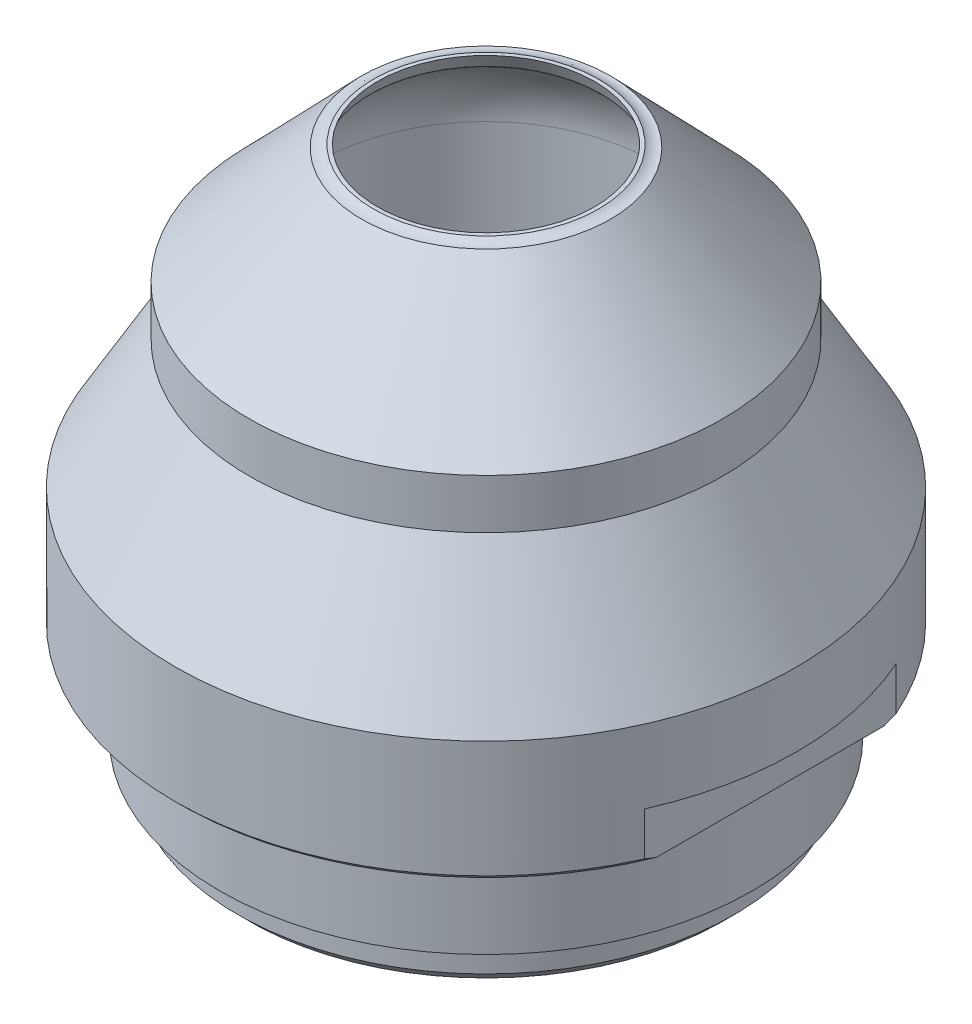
ISO-10303-21;
HEADER;
FILE_DESCRIPTION(('STEP AP214'),'2;1');
FILE_NAME('part.step','',(''),(''),'','','');
FILE_SCHEMA(('AUTOMOTIVE_DESIGN { 1 0 10303 214 1 1 1 1 }'));
ENDSEC;
DATA;
#1=APPLICATION_CONTEXT('core data for automotive mechanical design processes');
#2=APPLICATION_PROTOCOL_DEFINITION('international standard','automotive_design',2000,#1);
#3=PRODUCT_CONTEXT('',#1,'mechanical');
#4=PRODUCT('Part','Part','',(#3));
#5=PRODUCT_RELATED_PRODUCT_CATEGORY('part','',(#4));
#6=PRODUCT_DEFINITION_FORMATION('','',#4);
#7=PRODUCT_DEFINITION_CONTEXT('part definition',#1,'design');
#8=PRODUCT_DEFINITION('design','',#6,#7);
#9=PRODUCT_DEFINITION_SHAPE('','',#8);
#10=(LENGTH_UNIT() NAMED_UNIT(*) SI_UNIT(.MILLI.,.METRE.));
#11=(NAMED_UNIT(*) PLANE_ANGLE_UNIT() SI_UNIT($,.RADIAN.));
#12=(NAMED_UNIT(*) SI_UNIT($,.STERADIAN.) SOLID_ANGLE_UNIT());
#13=UNCERTAINTY_MEASURE_WITH_UNIT(LENGTH_MEASURE(1.E-05),#10,'distance_accuracy_value','');
#14=(GEOMETRIC_REPRESENTATION_CONTEXT(3) GLOBAL_UNCERTAINTY_ASSIGNED_CONTEXT((#13)) GLOBAL_UNIT_ASSIGNED_CONTEXT((#10,
#11,#12)) REPRESENTATION_CONTEXT('',''));
#15=CARTESIAN_POINT('',(0.,0.,0.));
#16=DIRECTION('',(0.,0.,1.));
#17=DIRECTION('',(1.,0.,0.));
#18=AXIS2_PLACEMENT_3D('',#15,#16,#17);
#19=CARTESIAN_POINT('',(52.5,23.,0.));
#20=DIRECTION('',(0.,-1.,0.));
#21=DIRECTION('',(0.,0.,-1.));
#22=AXIS2_PLACEMENT_3D('',#19,#20,#21);
#23=PLANE('',#22);
#24=CARTESIAN_POINT('',(0.,23.,0.));
#25=DIRECTION('',(0.,-1.,0.));
#26=DIRECTION('',(0.,0.,-1.));
#27=AXIS2_PLACEMENT_3D('',#24,#25,#26);
#28=CIRCLE('',#27,43.);
#29=CARTESIAN_POINT('',(0.,23.,-43.));
#30=VERTEX_POINT('',#29);
#31=EDGE_CURVE('E350',#30,#30,#28,.T.);
#32=ORIENTED_EDGE('',*,*,#31,.F.);
#33=EDGE_LOOP('',(#32));
#34=FACE_BOUND('',#33,.T.);
#35=CARTESIAN_POINT('',(0.,23.,0.));
#36=DIRECTION('',(0.,-1.,0.));
#37=DIRECTION('',(0.,0.,-1.));
#38=AXIS2_PLACEMENT_3D('',#35,#36,#37);
#39=CIRCLE('',#38,51.7);
#40=CARTESIAN_POINT('',(48.,23.,19.206509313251));
#41=VERTEX_POINT('',#40);
#42=CARTESIAN_POINT('',(-48.,23.,19.206509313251));
#43=VERTEX_POINT('',#42);
#44=EDGE_CURVE('E134',#41,#43,#39,.T.);
#45=ORIENTED_EDGE('',*,*,#44,.T.);
#46=DIRECTION('',(0.,0.,-1.));
#47=VECTOR('',#46,1.);
#48=CARTESIAN_POINT('',(-48.,23.,-52.5));
#49=LINE('',#48,#47);
#50=CARTESIAN_POINT('',(-48.,23.,-19.206509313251));
#51=VERTEX_POINT('',#50);
#52=EDGE_CURVE('E121',#43,#51,#49,.T.);
#53=ORIENTED_EDGE('',*,*,#52,.T.);
#54=CARTESIAN_POINT('',(48.,23.,-19.206509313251));
#55=VERTEX_POINT('',#54);
#56=EDGE_CURVE('E126',#51,#55,#39,.T.);
#57=ORIENTED_EDGE('',*,*,#56,.T.);
#58=DIRECTION('',(0.,0.,1.));
#59=VECTOR('',#58,1.);
#60=CARTESIAN_POINT('',(48.,23.,-52.5));
#61=LINE('',#60,#59);
#62=EDGE_CURVE('E107',#55,#41,#61,.T.);
#63=ORIENTED_EDGE('',*,*,#62,.T.);
#64=EDGE_LOOP('',(#45,#53,#57,#63));
#65=FACE_BOUND('',#64,.T.);
#66=ADVANCED_FACE('F48',(#34,#65),#23,.T.);
#67=CARTESIAN_POINT('',(0.,0.,0.));
#68=DIRECTION('',(0.,-1.,0.));
#69=DIRECTION('',(0.,0.,-1.));
#70=AXIS2_PLACEMENT_3D('',#67,#68,#69);
#71=CYLINDRICAL_SURFACE('',#70,52.5);
#72=CARTESIAN_POINT('',(0.,43.5,0.));
#73=DIRECTION('',(0.,-1.,0.));
#74=DIRECTION('',(0.,0.,-1.));
#75=AXIS2_PLACEMENT_3D('',#72,#73,#74);
#76=CIRCLE('',#75,52.5);
#77=CARTESIAN_POINT('',(0.,43.5,-52.5));
#78=VERTEX_POINT('',#77);
#79=EDGE_CURVE('E346',#78,#78,#76,.T.);
#80=ORIENTED_EDGE('',*,*,#79,.T.);
#81=EDGE_LOOP('',(#80));
#82=FACE_BOUND('',#81,.T.);
#83=CARTESIAN_POINT('',(0.,23.8,0.));
#84=DIRECTION('',(0.,-1.,0.));
#85=DIRECTION('',(0.,0.,-1.));
#86=AXIS2_PLACEMENT_3D('',#83,#84,#85);
#87=CIRCLE('',#86,52.5);
#88=CARTESIAN_POINT('',(48.,23.8,-21.2661703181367));
#89=VERTEX_POINT('',#88);
#90=CARTESIAN_POINT('',(-48.,23.8,-21.2661703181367));
#91=VERTEX_POINT('',#90);
#92=EDGE_CURVE('E128',#89,#91,#87,.F.);
#93=ORIENTED_EDGE('',*,*,#92,.T.);
#94=DIRECTION('',(0.,-1.,0.));
#95=VECTOR('',#94,1.);
#96=CARTESIAN_POINT('',(-48.,0.,-21.2661703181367));
#97=LINE('',#96,#95);
#98=CARTESIAN_POINT('',(-48.,31.1,-21.2661703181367));
#99=VERTEX_POINT('',#98);
#100=EDGE_CURVE('E74',#91,#99,#97,.F.);
#101=ORIENTED_EDGE('',*,*,#100,.T.);
#102=CARTESIAN_POINT('',(0.,31.1,0.));
#103=DIRECTION('',(0.,-1.,0.));
#104=DIRECTION('',(0.,0.,-1.));
#105=AXIS2_PLACEMENT_3D('',#102,#103,#104);
#106=CIRCLE('',#105,52.5);
#107=CARTESIAN_POINT('',(-48.,31.1,21.2661703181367));
#108=VERTEX_POINT('',#107);
#109=EDGE_CURVE('E12',#99,#108,#106,.F.);
#110=ORIENTED_EDGE('',*,*,#109,.T.);
#111=DIRECTION('',(0.,-1.,0.));
#112=VECTOR('',#111,1.);
#113=CARTESIAN_POINT('',(-48.,0.,21.2661703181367));
#114=LINE('',#113,#112);
#115=CARTESIAN_POINT('',(-48.,23.8,21.2661703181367));
#116=VERTEX_POINT('',#115);
#117=EDGE_CURVE('E325',#108,#116,#114,.T.);
#118=ORIENTED_EDGE('',*,*,#117,.T.);
#119=CARTESIAN_POINT('',(48.,23.8,21.2661703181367));
#120=VERTEX_POINT('',#119);
#121=EDGE_CURVE('E66',#116,#120,#87,.F.);
#122=ORIENTED_EDGE('',*,*,#121,.T.);
#123=DIRECTION('',(0.,-1.,0.));
#124=VECTOR('',#123,1.);
#125=CARTESIAN_POINT('',(48.,0.,21.2661703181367));
#126=LINE('',#125,#124);
#127=CARTESIAN_POINT('',(48.,31.1,21.2661703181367));
#128=VERTEX_POINT('',#127);
#129=EDGE_CURVE('E379',#120,#128,#126,.F.);
#130=ORIENTED_EDGE('',*,*,#129,.T.);
#131=CARTESIAN_POINT('',(48.,31.1,-21.2661703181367));
#132=VERTEX_POINT('',#131);
#133=EDGE_CURVE('E54',#128,#132,#106,.F.);
#134=ORIENTED_EDGE('',*,*,#133,.T.);
#135=DIRECTION('',(0.,-1.,0.));
#136=VECTOR('',#135,1.);
#137=CARTESIAN_POINT('',(48.,0.,-21.2661703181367));
#138=LINE('',#137,#136);
#139=EDGE_CURVE('E376',#132,#89,#138,.T.);
#140=ORIENTED_EDGE('',*,*,#139,.T.);
#141=EDGE_LOOP('',(#93,#101,#110,#118,#122,#130,#134,#140));
#142=FACE_BOUND('',#141,.T.);
#143=ADVANCED_FACE('F190',(#82,#142),#71,.T.);
#144=CARTESIAN_POINT('',(0.,23.,0.));
#145=DIRECTION('',(0.,1.,0.));
#146=DIRECTION('',(0.,0.,1.));
#147=AXIS2_PLACEMENT_3D('',#144,#145,#146);
#148=CONICAL_SURFACE('',#147,51.7,0.785398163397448);
#149=ORIENTED_EDGE('',*,*,#121,.F.);
#150=CARTESIAN_POINT('',(-48.,23.8007,21.2678983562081));
#151=CARTESIAN_POINT('',(-48.,23.4780380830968,20.4713682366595));
#152=CARTESIAN_POINT('',(-48.,23.1683333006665,19.6694717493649));
#153=CARTESIAN_POINT('',(-48.,22.5777835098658,18.0548097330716));
#154=CARTESIAN_POINT('',(-48.,22.2969490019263,17.2420403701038));
#155=CARTESIAN_POINT('',(-48.,21.7665878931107,15.6038014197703));
#156=CARTESIAN_POINT('',(-48.,21.5171504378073,14.7783028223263));
#157=CARTESIAN_POINT('',(-48.,21.0537162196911,13.1174706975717));
#158=CARTESIAN_POINT('',(-48.,20.8397157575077,12.2821382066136));
#159=CARTESIAN_POINT('',(-48.,20.4520041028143,10.6101230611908));
#160=CARTESIAN_POINT('',(-48.,20.2779448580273,9.77352147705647));
#161=CARTESIAN_POINT('',(-48.,19.9704373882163,8.09283112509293));
#162=CARTESIAN_POINT('',(-48.,19.8369900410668,7.2487421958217));
#163=CARTESIAN_POINT('',(-48.,19.6131888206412,5.5558330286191));
#164=CARTESIAN_POINT('',(-48.,19.5227853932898,4.70701937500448));
#165=CARTESIAN_POINT('',(-48.,19.3865489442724,3.00581930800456));
#166=CARTESIAN_POINT('',(-48.,19.3407148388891,2.15343298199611));
#167=CARTESIAN_POINT('',(-48.,19.2955554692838,0.486016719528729));
#168=CARTESIAN_POINT('',(-48.,19.2942204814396,-0.328959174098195));
#169=CARTESIAN_POINT('',(-48.,19.3330141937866,-1.95791628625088));
#170=CARTESIAN_POINT('',(-48.,19.3731426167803,-2.77189751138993));
#171=CARTESIAN_POINT('',(-48.,19.4941712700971,-4.39718354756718));
#172=CARTESIAN_POINT('',(-48.,19.5750902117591,-5.20848695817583));
#173=CARTESIAN_POINT('',(-48.,19.7763075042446,-6.82616966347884));
#174=CARTESIAN_POINT('',(-48.,19.8966059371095,-7.63254894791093));
#175=CARTESIAN_POINT('',(-48.,20.174534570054,-9.2382314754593));
#176=CARTESIAN_POINT('',(-48.,20.3321377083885,-10.0375394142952));
#177=CARTESIAN_POINT('',(-48.,20.682353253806,-11.6283792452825));
#178=CARTESIAN_POINT('',(-48.,20.8749664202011,-12.4199109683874));
#179=CARTESIAN_POINT('',(-48.,21.5013346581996,-14.7808936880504));
#180=CARTESIAN_POINT('',(-48.,21.9837881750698,-16.3376809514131));
#181=CARTESIAN_POINT('',(-48.,22.7196118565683,-18.446242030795));
#182=CARTESIAN_POINT('',(-48.,22.9264608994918,-19.0149060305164));
#183=CARTESIAN_POINT('',(-48.,23.3536473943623,-20.1458505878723));
#184=CARTESIAN_POINT('',(-48.,23.5739570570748,-20.7081416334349));
#185=CARTESIAN_POINT('',(-48.,23.8007,-21.2678983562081));
#186=B_SPLINE_CURVE_WITH_KNOTS('',3,(#150,#151,#152,#153,#154,#155,#156,#157,#158,#159,#160,
#161,#162,#163,#164,#165,#166,#167,#168,#169,#170,#171,#172,#173,#174,#175,#176,#177,#178,#179,
#180,#181,#182,#183,#184,#185),.UNSPECIFIED.,.F.,.F.,(4,2,2,2,2,2,2,2,2,2,2,2,2,2,2,2,2,4),(0.,
2.57825242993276,5.1574393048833,7.74379154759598,10.3298736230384,12.8924833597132,
15.4551484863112,18.0148561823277,20.5745016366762,23.0183807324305,25.4622434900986,
27.9072283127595,30.3522182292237,32.795439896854,35.2387145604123,40.1223815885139,
41.937635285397,43.7492603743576),.UNSPECIFIED.);
#187=EDGE_CURVE('E395',#116,#43,#186,.T.);
#188=ORIENTED_EDGE('',*,*,#187,.T.);
#189=ORIENTED_EDGE('',*,*,#44,.F.);
#190=CARTESIAN_POINT('',(48.,23.8007,-21.2678983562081));
#191=CARTESIAN_POINT('',(48.,23.4780380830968,-20.4713682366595));
#192=CARTESIAN_POINT('',(48.,23.1683333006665,-19.6694717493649));
#193=CARTESIAN_POINT('',(48.,22.5777835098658,-18.0548097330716));
#194=CARTESIAN_POINT('',(48.,22.2969490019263,-17.2420403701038));
#195=CARTESIAN_POINT('',(48.,21.7665878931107,-15.6038014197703));
#196=CARTESIAN_POINT('',(48.,21.5171504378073,-14.7783028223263));
#197=CARTESIAN_POINT('',(48.,21.0537162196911,-13.1174706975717));
#198=CARTESIAN_POINT('',(48.,20.8397157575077,-12.2821382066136));
#199=CARTESIAN_POINT('',(48.,20.4520041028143,-10.6101230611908));
#200=CARTESIAN_POINT('',(48.,20.2779448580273,-9.77352147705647));
#201=CARTESIAN_POINT('',(48.,19.9704373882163,-8.09283112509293));
#202=CARTESIAN_POINT('',(48.,19.8369900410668,-7.2487421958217));
#203=CARTESIAN_POINT('',(48.,19.6131888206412,-5.5558330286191));
#204=CARTESIAN_POINT('',(48.,19.5227853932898,-4.70701937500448));
#205=CARTESIAN_POINT('',(48.,19.3865489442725,-3.00581930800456));
#206=CARTESIAN_POINT('',(48.,19.3407148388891,-2.15343298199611));
#207=CARTESIAN_POINT('',(48.,19.2955554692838,-0.486016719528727));
#208=CARTESIAN_POINT('',(48.,19.2942204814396,0.328959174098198));
#209=CARTESIAN_POINT('',(48.,19.3330141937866,1.95791628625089));
#210=CARTESIAN_POINT('',(48.,19.3731426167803,2.77189751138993));
#211=CARTESIAN_POINT('',(48.,19.4941712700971,4.39718354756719));
#212=CARTESIAN_POINT('',(48.,19.5750902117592,5.20848695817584));
#213=CARTESIAN_POINT('',(48.,19.7763075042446,6.82616966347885));
#214=CARTESIAN_POINT('',(48.,19.8966059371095,7.63254894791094));
#215=CARTESIAN_POINT('',(48.,20.174534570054,9.2382314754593));
#216=CARTESIAN_POINT('',(48.,20.3321377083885,10.0375394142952));
#217=CARTESIAN_POINT('',(48.,20.6823532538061,11.6283792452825));
#218=CARTESIAN_POINT('',(48.,20.8749664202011,12.4199109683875));
#219=CARTESIAN_POINT('',(48.,21.5013346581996,14.7808936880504));
#220=CARTESIAN_POINT('',(48.,21.9837881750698,16.3376809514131));
#221=CARTESIAN_POINT('',(48.,22.7196118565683,18.446242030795));
#222=CARTESIAN_POINT('',(48.,22.9264608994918,19.0149060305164));
#223=CARTESIAN_POINT('',(48.,23.3536473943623,20.1458505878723));
#224=CARTESIAN_POINT('',(48.,23.5739570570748,20.7081416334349));
#225=CARTESIAN_POINT('',(48.,23.8007,21.2678983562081));
#226=B_SPLINE_CURVE_WITH_KNOTS('',3,(#190,#191,#192,#193,#194,#195,#196,#197,#198,#199,#200,
#201,#202,#203,#204,#205,#206,#207,#208,#209,#210,#211,#212,#213,#214,#215,#216,#217,#218,#219,
#220,#221,#222,#223,#224,#225),.UNSPECIFIED.,.F.,.F.,(4,2,2,2,2,2,2,2,2,2,2,2,2,2,2,2,2,4),(0.,
2.57825242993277,5.15743930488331,7.74379154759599,10.3298736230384,12.8924833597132,
15.4551484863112,18.0148561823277,20.5745016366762,23.0183807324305,25.4622434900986,
27.9072283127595,30.3522182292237,32.795439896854,35.2387145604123,40.1223815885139,
41.937635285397,43.7492603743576),.UNSPECIFIED.);
#227=EDGE_CURVE('E114',#41,#120,#226,.T.);
#228=ORIENTED_EDGE('',*,*,#227,.T.);
#229=EDGE_LOOP('',(#149,#188,#189,#228));
#230=FACE_BOUND('',#229,.T.);
#231=ADVANCED_FACE('F51',(#230),#148,.T.);
#232=ORIENTED_EDGE('',*,*,#56,.F.);
#233=EDGE_CURVE('E130',#51,#91,#186,.T.);
#234=ORIENTED_EDGE('',*,*,#233,.T.);
#235=ORIENTED_EDGE('',*,*,#92,.F.);
#236=EDGE_CURVE('E111',#89,#55,#226,.T.);
#237=ORIENTED_EDGE('',*,*,#236,.T.);
#238=EDGE_LOOP('',(#232,#234,#235,#237));
#239=FACE_BOUND('',#238,.T.);
#240=ADVANCED_FACE('F125',(#239),#148,.T.);
#241=CARTESIAN_POINT('',(0.,93.7,0.));
#242=DIRECTION('',(0.,-1.,0.));
#243=DIRECTION('',(0.,0.,-1.));
#244=AXIS2_PLACEMENT_3D('',#241,#242,#243);
#245=CONICAL_SURFACE('',#244,18.35,0.436332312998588);
#246=CARTESIAN_POINT('',(0.,91.3138254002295,0.));
#247=DIRECTION('',(0.,1.,0.));
#248=DIRECTION('',(0.,0.,1.));
#249=AXIS2_PLACEMENT_3D('',#246,#247,#248);
#250=CIRCLE('',#249,19.4626914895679);
#251=CARTESIAN_POINT('',(0.,91.3138254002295,19.4626914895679));
#252=VERTEX_POINT('',#251);
#253=EDGE_CURVE('E305',#252,#252,#250,.F.);
#254=ORIENTED_EDGE('',*,*,#253,.T.);
#255=EDGE_LOOP('',(#254));
#256=FACE_BOUND('',#255,.T.);
#257=CARTESIAN_POINT('',(0.,93.7,0.));
#258=DIRECTION('',(0.,-1.,0.));
#259=DIRECTION('',(0.,0.,-1.));
#260=AXIS2_PLACEMENT_3D('',#257,#258,#259);
#261=CIRCLE('',#260,18.35);
#262=CARTESIAN_POINT('',(0.,93.7,-18.35));
#263=VERTEX_POINT('',#262);
#264=EDGE_CURVE('E322',#263,#263,#261,.T.);
#265=ORIENTED_EDGE('',*,*,#264,.F.);
#266=EDGE_LOOP('',(#265));
#267=FACE_BOUND('',#266,.T.);
#268=ADVANCED_FACE('F235',(#256,#267),#245,.F.);
#269=CARTESIAN_POINT('',(0.,76.8463224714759,0.));
#270=DIRECTION('',(0.,-1.,0.));
#271=DIRECTION('',(0.,0.,-1.));
#272=AXIS2_PLACEMENT_3D('',#269,#270,#271);
#273=DEGENERATE_TOROIDAL_SURFACE('',#272,12.5,16.,.T.);
#274=CARTESIAN_POINT('',(0.,91.1952775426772,0.));
#275=DIRECTION('',(0.,-1.,0.));
#276=DIRECTION('',(0.,0.,-1.));
#277=AXIS2_PLACEMENT_3D('',#274,#275,#276);
#278=CIRCLE('',#277,19.5786643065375);
#279=CARTESIAN_POINT('',(0.,91.1952775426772,-19.5786643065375));
#280=VERTEX_POINT('',#279);
#281=EDGE_CURVE('E309',#280,#280,#278,.F.);
#282=ORIENTED_EDGE('',*,*,#281,.T.);
#283=EDGE_LOOP('',(#282));
#284=FACE_BOUND('',#283,.T.);
#285=CARTESIAN_POINT('',(0.,76.8463224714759,0.));
#286=DIRECTION('',(0.,-1.,0.));
#287=DIRECTION('',(0.,0.,-1.));
#288=AXIS2_PLACEMENT_3D('',#285,#286,#287);
#289=CIRCLE('',#288,28.5);
#290=CARTESIAN_POINT('',(0.,76.8463224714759,-28.5));
#291=VERTEX_POINT('',#290);
#292=EDGE_CURVE('E286',#291,#291,#289,.T.);
#293=ORIENTED_EDGE('',*,*,#292,.T.);
#294=EDGE_LOOP('',(#293));
#295=FACE_BOUND('',#294,.T.);
#296=ADVANCED_FACE('F231',(#284,#295),#273,.F.);
#297=CARTESIAN_POINT('',(0.,0.,0.));
#298=DIRECTION('',(0.,-1.,0.));
#299=DIRECTION('',(0.,0.,-1.));
#300=AXIS2_PLACEMENT_3D('',#297,#298,#299);
#301=CYLINDRICAL_SURFACE('',#300,28.5);
#302=CARTESIAN_POINT('',(0.,50.0332551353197,0.));
#303=DIRECTION('',(0.,1.,0.));
#304=DIRECTION('',(0.,0.,1.));
#305=AXIS2_PLACEMENT_3D('',#302,#303,#304);
#306=CIRCLE('',#305,28.5);
#307=CARTESIAN_POINT('',(0.,50.0332551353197,28.5));
#308=VERTEX_POINT('',#307);
#309=EDGE_CURVE('E140',#308,#308,#306,.F.);
#310=ORIENTED_EDGE('',*,*,#309,.T.);
#311=EDGE_LOOP('',(#310));
#312=FACE_BOUND('',#311,.T.);
#313=ORIENTED_EDGE('',*,*,#292,.F.);
#314=EDGE_LOOP('',(#313));
#315=FACE_BOUND('',#314,.T.);
#316=ADVANCED_FACE('F227',(#312,#315),#301,.F.);
#317=CARTESIAN_POINT('',(0.,50.,0.));
#318=DIRECTION('',(0.,-1.,0.));
#319=DIRECTION('',(0.,0.,-1.));
#320=AXIS2_PLACEMENT_3D('',#317,#318,#319);
#321=CONICAL_SURFACE('',#320,28.5,0.264488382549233);
#322=CARTESIAN_POINT('',(0.,26.0320987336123,0.));
#323=DIRECTION('',(0.,-1.,0.));
#324=DIRECTION('',(0.,0.,-1.));
#325=AXIS2_PLACEMENT_3D('',#322,#323,#324);
#326=CIRCLE('',#325,34.99130659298);
#327=CARTESIAN_POINT('',(0.,26.0320987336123,-34.99130659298));
#328=VERTEX_POINT('',#327);
#329=EDGE_CURVE('E269',#328,#328,#326,.T.);
#330=ORIENTED_EDGE('',*,*,#329,.T.);
#331=EDGE_LOOP('',(#330));
#332=FACE_BOUND('',#331,.T.);
#333=CARTESIAN_POINT('',(0.,49.9679012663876,0.));
#334=DIRECTION('',(0.,1.,0.));
#335=DIRECTION('',(0.,0.,1.));
#336=AXIS2_PLACEMENT_3D('',#333,#334,#335);
#337=CIRCLE('',#336,28.50869340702);
#338=CARTESIAN_POINT('',(0.,49.9679012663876,28.50869340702));
#339=VERTEX_POINT('',#338);
#340=EDGE_CURVE('E276',#339,#339,#337,.T.);
#341=ORIENTED_EDGE('',*,*,#340,.T.);
#342=EDGE_LOOP('',(#341));
#343=FACE_BOUND('',#342,.T.);
#344=ADVANCED_FACE('F223',(#332,#343),#321,.F.);
#345=CARTESIAN_POINT('',(0.,0.,0.));
#346=DIRECTION('',(0.,-1.,0.));
#347=DIRECTION('',(0.,0.,-1.));
#348=AXIS2_PLACEMENT_3D('',#345,#346,#347);
#349=CYLINDRICAL_SURFACE('',#348,35.);
#350=CARTESIAN_POINT('',(0.,25.9667448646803,0.));
#351=DIRECTION('',(0.,-1.,0.));
#352=DIRECTION('',(0.,0.,-1.));
#353=AXIS2_PLACEMENT_3D('',#350,#351,#352);
#354=CIRCLE('',#353,35.);
#355=CARTESIAN_POINT('',(0.,25.9667448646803,-35.));
#356=VERTEX_POINT('',#355);
#357=EDGE_CURVE('E268',#356,#356,#354,.F.);
#358=ORIENTED_EDGE('',*,*,#357,.T.);
#359=EDGE_LOOP('',(#358));
#360=FACE_BOUND('',#359,.T.);
#361=CARTESIAN_POINT('',(0.,0.249999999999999,0.));
#362=DIRECTION('',(0.,-1.,0.));
#363=DIRECTION('',(0.,0.,-1.));
#364=AXIS2_PLACEMENT_3D('',#361,#362,#363);
#365=CIRCLE('',#364,35.);
#366=CARTESIAN_POINT('',(0.,0.249999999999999,-35.));
#367=VERTEX_POINT('',#366);
#368=EDGE_CURVE('E265',#367,#367,#365,.T.);
#369=ORIENTED_EDGE('',*,*,#368,.T.);
#370=EDGE_LOOP('',(#369));
#371=FACE_BOUND('',#370,.T.);
#372=ADVANCED_FACE('F219',(#360,#371),#349,.F.);
#373=CARTESIAN_POINT('',(41.95,0.,0.));
#374=DIRECTION('',(0.,-1.,0.));
#375=DIRECTION('',(0.,0.,-1.));
#376=AXIS2_PLACEMENT_3D('',#373,#374,#375);
#377=PLANE('',#376);
#378=CARTESIAN_POINT('',(0.,0.,0.));
#379=DIRECTION('',(0.,-1.,0.));
#380=DIRECTION('',(0.,0.,-1.));
#381=AXIS2_PLACEMENT_3D('',#378,#379,#380);
#382=CIRCLE('',#381,35.25);
#383=CARTESIAN_POINT('',(0.,0.,-35.25));
#384=VERTEX_POINT('',#383);
#385=EDGE_CURVE('E135',#384,#384,#382,.F.);
#386=ORIENTED_EDGE('',*,*,#385,.T.);
#387=EDGE_LOOP('',(#386));
#388=FACE_BOUND('',#387,.T.);
#389=CARTESIAN_POINT('',(0.,0.,0.));
#390=DIRECTION('',(0.,-1.,0.));
#391=DIRECTION('',(0.,0.,-1.));
#392=AXIS2_PLACEMENT_3D('',#389,#390,#391);
#393=CIRCLE('',#392,39.95);
#394=CARTESIAN_POINT('',(0.,0.,-39.95));
#395=VERTEX_POINT('',#394);
#396=EDGE_CURVE('E289',#395,#395,#393,.T.);
#397=ORIENTED_EDGE('',*,*,#396,.T.);
#398=EDGE_LOOP('',(#397));
#399=FACE_BOUND('',#398,.T.);
#400=ADVANCED_FACE('F215',(#388,#399),#377,.T.);
#401=CARTESIAN_POINT('',(0.,0.,0.));
#402=DIRECTION('',(0.,-1.,0.));
#403=DIRECTION('',(0.,0.,-1.));
#404=AXIS2_PLACEMENT_3D('',#401,#402,#403);
#405=CYLINDRICAL_SURFACE('',#404,41.95);
#406=CARTESIAN_POINT('',(0.,2.00000000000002,0.));
#407=DIRECTION('',(0.,-1.,0.));
#408=DIRECTION('',(0.,0.,-1.));
#409=AXIS2_PLACEMENT_3D('',#406,#407,#408);
#410=CIRCLE('',#409,41.95);
#411=CARTESIAN_POINT('',(0.,2.00000000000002,-41.95));
#412=VERTEX_POINT('',#411);
#413=EDGE_CURVE('E295',#412,#412,#410,.F.);
#414=ORIENTED_EDGE('',*,*,#413,.T.);
#415=EDGE_LOOP('',(#414));
#416=FACE_BOUND('',#415,.T.);
#417=CARTESIAN_POINT('',(0.,7.,0.));
#418=DIRECTION('',(0.,-1.,0.));
#419=DIRECTION('',(0.,0.,-1.));
#420=AXIS2_PLACEMENT_3D('',#417,#418,#419);
#421=CIRCLE('',#420,41.95);
#422=CARTESIAN_POINT('',(0.,7.,-41.95));
#423=VERTEX_POINT('',#422);
#424=EDGE_CURVE('E290',#423,#423,#421,.T.);
#425=ORIENTED_EDGE('',*,*,#424,.T.);
#426=EDGE_LOOP('',(#425));
#427=FACE_BOUND('',#426,.T.);
#428=ADVANCED_FACE('F211',(#416,#427),#405,.T.);
#429=CARTESIAN_POINT('',(45.,7.,0.));
#430=DIRECTION('',(0.,-1.,0.));
#431=DIRECTION('',(0.,0.,-1.));
#432=AXIS2_PLACEMENT_3D('',#429,#430,#431);
#433=PLANE('',#432);
#434=CARTESIAN_POINT('',(0.,7.,0.));
#435=DIRECTION('',(0.,-1.,0.));
#436=DIRECTION('',(0.,0.,-1.));
#437=AXIS2_PLACEMENT_3D('',#434,#435,#436);
#438=CIRCLE('',#437,45.);
#439=CARTESIAN_POINT('',(0.,7.,-45.));
#440=VERTEX_POINT('',#439);
#441=EDGE_CURVE('E298',#440,#440,#438,.T.);
#442=ORIENTED_EDGE('',*,*,#441,.T.);
#443=EDGE_LOOP('',(#442));
#444=FACE_BOUND('',#443,.T.);
#445=ORIENTED_EDGE('',*,*,#424,.F.);
#446=EDGE_LOOP('',(#445));
#447=FACE_BOUND('',#446,.T.);
#448=ADVANCED_FACE('F207',(#444,#447),#433,.T.);
#449=CARTESIAN_POINT('',(0.,0.,0.));
#450=DIRECTION('',(0.,-1.,0.));
#451=DIRECTION('',(0.,0.,-1.));
#452=AXIS2_PLACEMENT_3D('',#449,#450,#451);
#453=CYLINDRICAL_SURFACE('',#452,45.);
#454=CARTESIAN_POINT('',(0.,20.7,0.));
#455=DIRECTION('',(0.,-1.,0.));
#456=DIRECTION('',(0.,0.,-1.));
#457=AXIS2_PLACEMENT_3D('',#454,#455,#456);
#458=CIRCLE('',#457,45.);
#459=CARTESIAN_POINT('',(0.,20.7,-45.));
#460=VERTEX_POINT('',#459);
#461=EDGE_CURVE('E358',#460,#460,#458,.T.);
#462=ORIENTED_EDGE('',*,*,#461,.T.);
#463=EDGE_LOOP('',(#462));
#464=FACE_BOUND('',#463,.T.);
#465=ORIENTED_EDGE('',*,*,#441,.F.);
#466=EDGE_LOOP('',(#465));
#467=FACE_BOUND('',#466,.T.);
#468=ADVANCED_FACE('F203',(#464,#467),#453,.T.);
#469=CARTESIAN_POINT('',(43.,20.7,0.));
#470=DIRECTION('',(0.,1.,0.));
#471=DIRECTION('',(0.,0.,1.));
#472=AXIS2_PLACEMENT_3D('',#469,#470,#471);
#473=PLANE('',#472);
#474=CARTESIAN_POINT('',(0.,20.7,0.));
#475=DIRECTION('',(0.,-1.,0.));
#476=DIRECTION('',(0.,0.,-1.));
#477=AXIS2_PLACEMENT_3D('',#474,#475,#476);
#478=CIRCLE('',#477,43.);
#479=CARTESIAN_POINT('',(0.,20.7,-43.));
#480=VERTEX_POINT('',#479);
#481=EDGE_CURVE('E354',#480,#480,#478,.T.);
#482=ORIENTED_EDGE('',*,*,#481,.T.);
#483=EDGE_LOOP('',(#482));
#484=FACE_BOUND('',#483,.T.);
#485=ORIENTED_EDGE('',*,*,#461,.F.);
#486=EDGE_LOOP('',(#485));
#487=FACE_BOUND('',#486,.T.);
#488=ADVANCED_FACE('F199',(#484,#487),#473,.T.);
#489=CARTESIAN_POINT('',(0.,0.,0.));
#490=DIRECTION('',(0.,-1.,0.));
#491=DIRECTION('',(0.,0.,-1.));
#492=AXIS2_PLACEMENT_3D('',#489,#490,#491);
#493=CYLINDRICAL_SURFACE('',#492,43.);
#494=ORIENTED_EDGE('',*,*,#31,.T.);
#495=EDGE_LOOP('',(#494));
#496=FACE_BOUND('',#495,.T.);
#497=ORIENTED_EDGE('',*,*,#481,.F.);
#498=EDGE_LOOP('',(#497));
#499=FACE_BOUND('',#498,.T.);
#500=ADVANCED_FACE('F188',(#496,#499),#493,.T.);
#501=CARTESIAN_POINT('',(0.,43.5,0.));
#502=DIRECTION('',(0.,-1.,0.));
#503=DIRECTION('',(0.,0.,-1.));
#504=AXIS2_PLACEMENT_3D('',#501,#502,#503);
#505=CONICAL_SURFACE('',#504,52.5,0.523598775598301);
#506=CARTESIAN_POINT('',(0.,65.1506350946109,0.));
#507=DIRECTION('',(0.,-1.,0.));
#508=DIRECTION('',(0.,0.,-1.));
#509=AXIS2_PLACEMENT_3D('',#506,#507,#508);
#510=CIRCLE('',#509,40.);
#511=CARTESIAN_POINT('',(0.,65.1506350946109,-40.));
#512=VERTEX_POINT('',#511);
#513=EDGE_CURVE('E342',#512,#512,#510,.T.);
#514=ORIENTED_EDGE('',*,*,#513,.T.);
#515=EDGE_LOOP('',(#514));
#516=FACE_BOUND('',#515,.T.);
#517=ORIENTED_EDGE('',*,*,#79,.F.);
#518=EDGE_LOOP('',(#517));
#519=FACE_BOUND('',#518,.T.);
#520=ADVANCED_FACE('F184',(#516,#519),#505,.T.);
#521=CARTESIAN_POINT('',(0.,0.,0.));
#522=DIRECTION('',(0.,-1.,0.));
#523=DIRECTION('',(0.,0.,-1.));
#524=AXIS2_PLACEMENT_3D('',#521,#522,#523);
#525=CYLINDRICAL_SURFACE('',#524,40.);
#526=CARTESIAN_POINT('',(0.,73.5249240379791,0.));
#527=DIRECTION('',(0.,-1.,0.));
#528=DIRECTION('',(0.,0.,-1.));
#529=AXIS2_PLACEMENT_3D('',#526,#527,#528);
#530=CIRCLE('',#529,40.);
#531=CARTESIAN_POINT('',(0.,73.5249240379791,-40.));
#532=VERTEX_POINT('',#531);
#533=EDGE_CURVE('E338',#532,#532,#530,.T.);
#534=ORIENTED_EDGE('',*,*,#533,.T.);
#535=EDGE_LOOP('',(#534));
#536=FACE_BOUND('',#535,.T.);
#537=ORIENTED_EDGE('',*,*,#513,.F.);
#538=EDGE_LOOP('',(#537));
#539=FACE_BOUND('',#538,.T.);
#540=ADVANCED_FACE('F180',(#536,#539),#525,.T.);
#541=CARTESIAN_POINT('',(0.,73.5249240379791,0.));
#542=DIRECTION('',(0.,-1.,0.));
#543=DIRECTION('',(0.,0.,-1.));
#544=AXIS2_PLACEMENT_3D('',#541,#542,#543);
#545=CONICAL_SURFACE('',#544,40.,0.767944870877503);
#546=CARTESIAN_POINT('',(0.,93.2,0.));
#547=DIRECTION('',(0.,-1.,0.));
#548=DIRECTION('',(0.,0.,-1.));
#549=AXIS2_PLACEMENT_3D('',#546,#547,#548);
#550=CIRCLE('',#549,21.);
#551=CARTESIAN_POINT('',(0.,93.2,-21.));
#552=VERTEX_POINT('',#551);
#553=EDGE_CURVE('E330',#552,#552,#550,.T.);
#554=ORIENTED_EDGE('',*,*,#553,.T.);
#555=EDGE_LOOP('',(#554));
#556=FACE_BOUND('',#555,.T.);
#557=ORIENTED_EDGE('',*,*,#533,.F.);
#558=EDGE_LOOP('',(#557));
#559=FACE_BOUND('',#558,.T.);
#560=ADVANCED_FACE('F176',(#556,#559),#545,.T.);
#561=CARTESIAN_POINT('',(0.,96.1832376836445,0.));
#562=DIRECTION('',(0.,-1.,0.));
#563=DIRECTION('',(0.,0.,-1.));
#564=AXIS2_PLACEMENT_3D('',#561,#562,#563);
#565=TOROIDAL_SURFACE('',#564,20.6833094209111,3.);
#566=CARTESIAN_POINT('',(0.,93.7,0.));
#567=DIRECTION('',(0.,-1.,0.));
#568=DIRECTION('',(0.,0.,-1.));
#569=AXIS2_PLACEMENT_3D('',#566,#567,#568);
#570=CIRCLE('',#569,19.);
#571=CARTESIAN_POINT('',(0.,93.7,-19.));
#572=VERTEX_POINT('',#571);
#573=EDGE_CURVE('E324',#572,#572,#570,.T.);
#574=ORIENTED_EDGE('',*,*,#573,.T.);
#575=EDGE_LOOP('',(#574));
#576=FACE_BOUND('',#575,.T.);
#577=ORIENTED_EDGE('',*,*,#553,.F.);
#578=EDGE_LOOP('',(#577));
#579=FACE_BOUND('',#578,.T.);
#580=ADVANCED_FACE('F172',(#576,#579),#565,.F.);
#581=CARTESIAN_POINT('',(18.35,93.7,0.));
#582=DIRECTION('',(0.,1.,0.));
#583=DIRECTION('',(0.,0.,1.));
#584=AXIS2_PLACEMENT_3D('',#581,#582,#583);
#585=PLANE('',#584);
#586=ORIENTED_EDGE('',*,*,#264,.T.);
#587=EDGE_LOOP('',(#586));
#588=FACE_BOUND('',#587,.T.);
#589=ORIENTED_EDGE('',*,*,#573,.F.);
#590=EDGE_LOOP('',(#589));
#591=FACE_BOUND('',#590,.T.);
#592=ADVANCED_FACE('F168',(#588,#591),#585,.T.);
#593=CARTESIAN_POINT('',(0.,0.,0.));
#594=DIRECTION('',(0.,1.,0.));
#595=DIRECTION('',(0.,0.,1.));
#596=AXIS2_PLACEMENT_3D('',#593,#594,#595);
#597=CONICAL_SURFACE('',#596,39.95,0.785398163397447);
#598=ORIENTED_EDGE('',*,*,#413,.F.);
#599=EDGE_LOOP('',(#598));
#600=FACE_BOUND('',#599,.T.);
#601=ORIENTED_EDGE('',*,*,#396,.F.);
#602=EDGE_LOOP('',(#601));
#603=FACE_BOUND('',#602,.T.);
#604=ADVANCED_FACE('F171',(#600,#603),#597,.T.);
#605=CARTESIAN_POINT('',(0.,91.4194799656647,0.));
#606=DIRECTION('',(0.,1.,0.));
#607=DIRECTION('',(0.,0.,1.));
#608=AXIS2_PLACEMENT_3D('',#605,#606,#607);
#609=TOROIDAL_SURFACE('',#608,19.6892684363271,0.25);
#610=ORIENTED_EDGE('',*,*,#281,.F.);
#611=EDGE_LOOP('',(#610));
#612=FACE_BOUND('',#611,.T.);
#613=ORIENTED_EDGE('',*,*,#253,.F.);
#614=EDGE_LOOP('',(#613));
#615=FACE_BOUND('',#614,.T.);
#616=ADVANCED_FACE('F245',(#612,#615),#609,.T.);
#617=CARTESIAN_POINT('',(0.,25.9667448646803,0.));
#618=DIRECTION('',(0.,-1.,0.));
#619=DIRECTION('',(0.,0.,-1.));
#620=AXIS2_PLACEMENT_3D('',#617,#618,#619);
#621=TOROIDAL_SURFACE('',#620,34.75,0.25);
#622=ORIENTED_EDGE('',*,*,#357,.F.);
#623=EDGE_LOOP('',(#622));
#624=FACE_BOUND('',#623,.T.);
#625=ORIENTED_EDGE('',*,*,#329,.F.);
#626=EDGE_LOOP('',(#625));
#627=FACE_BOUND('',#626,.T.);
#628=ADVANCED_FACE('F249',(#624,#627),#621,.F.);
#629=CARTESIAN_POINT('',(0.,50.0332551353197,0.));
#630=DIRECTION('',(0.,1.,0.));
#631=DIRECTION('',(0.,0.,1.));
#632=AXIS2_PLACEMENT_3D('',#629,#630,#631);
#633=TOROIDAL_SURFACE('',#632,28.75,0.25);
#634=ORIENTED_EDGE('',*,*,#340,.F.);
#635=EDGE_LOOP('',(#634));
#636=FACE_BOUND('',#635,.T.);
#637=ORIENTED_EDGE('',*,*,#309,.F.);
#638=EDGE_LOOP('',(#637));
#639=FACE_BOUND('',#638,.T.);
#640=ADVANCED_FACE('F253',(#636,#639),#633,.T.);
#641=CARTESIAN_POINT('',(0.,0.249999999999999,0.));
#642=DIRECTION('',(0.,-1.,0.));
#643=DIRECTION('',(0.,0.,-1.));
#644=AXIS2_PLACEMENT_3D('',#641,#642,#643);
#645=TOROIDAL_SURFACE('',#644,35.25,0.25);
#646=ORIENTED_EDGE('',*,*,#385,.F.);
#647=EDGE_LOOP('',(#646));
#648=FACE_BOUND('',#647,.T.);
#649=ORIENTED_EDGE('',*,*,#368,.F.);
#650=EDGE_LOOP('',(#649));
#651=FACE_BOUND('',#650,.T.);
#652=ADVANCED_FACE('F159',(#648,#651),#645,.T.);
#653=CARTESIAN_POINT('',(48.,31.1,-52.5));
#654=DIRECTION('',(1.,0.,0.));
#655=DIRECTION('',(0.,0.,-1.));
#656=AXIS2_PLACEMENT_3D('',#653,#654,#655);
#657=PLANE('',#656);
#658=DIRECTION('',(0.,0.,1.));
#659=VECTOR('',#658,1.);
#660=CARTESIAN_POINT('',(48.,31.1,-52.5));
#661=LINE('',#660,#659);
#662=EDGE_CURVE('E383',#132,#128,#661,.T.);
#663=ORIENTED_EDGE('',*,*,#662,.T.);
#664=ORIENTED_EDGE('',*,*,#129,.F.);
#665=ORIENTED_EDGE('',*,*,#227,.F.);
#666=ORIENTED_EDGE('',*,*,#62,.F.);
#667=ORIENTED_EDGE('',*,*,#236,.F.);
#668=ORIENTED_EDGE('',*,*,#139,.F.);
#669=EDGE_LOOP('',(#663,#664,#665,#666,#667,#668));
#670=FACE_BOUND('',#669,.T.);
#671=ADVANCED_FACE('F110',(#670),#657,.T.);
#672=CARTESIAN_POINT('',(0.,31.1,0.));
#673=DIRECTION('',(0.,-1.,0.));
#674=DIRECTION('',(0.,0.,-1.));
#675=AXIS2_PLACEMENT_3D('',#672,#673,#674);
#676=PLANE('',#675);
#677=ORIENTED_EDGE('',*,*,#662,.F.);
#678=ORIENTED_EDGE('',*,*,#133,.F.);
#679=EDGE_LOOP('',(#677,#678));
#680=FACE_BOUND('',#679,.T.);
#681=ADVANCED_FACE('F158',(#680),#676,.T.);
#682=DIRECTION('',(0.,0.,-1.));
#683=VECTOR('',#682,1.);
#684=CARTESIAN_POINT('',(-48.,31.1,-52.5));
#685=LINE('',#684,#683);
#686=EDGE_CURVE('E120',#108,#99,#685,.T.);
#687=ORIENTED_EDGE('',*,*,#686,.F.);
#688=ORIENTED_EDGE('',*,*,#109,.F.);
#689=EDGE_LOOP('',(#687,#688));
#690=FACE_BOUND('',#689,.T.);
#691=ADVANCED_FACE('F164',(#690),#676,.T.);
#692=CARTESIAN_POINT('',(-48.,31.1,-52.5));
#693=DIRECTION('',(-1.,0.,0.));
#694=DIRECTION('',(0.,0.,1.));
#695=AXIS2_PLACEMENT_3D('',#692,#693,#694);
#696=PLANE('',#695);
#697=ORIENTED_EDGE('',*,*,#686,.T.);
#698=ORIENTED_EDGE('',*,*,#100,.F.);
#699=ORIENTED_EDGE('',*,*,#233,.F.);
#700=ORIENTED_EDGE('',*,*,#52,.F.);
#701=ORIENTED_EDGE('',*,*,#187,.F.);
#702=ORIENTED_EDGE('',*,*,#117,.F.);
#703=EDGE_LOOP('',(#697,#698,#699,#700,#701,#702));
#704=FACE_BOUND('',#703,.T.);
#705=ADVANCED_FACE('F160',(#704),#696,.T.);
#706=CLOSED_SHELL('',(#66,#143,#231,#240,#268,#296,#316,#344,#372,#400,#428,#448,#468,#488,#500,
#520,#540,#560,#580,#592,#604,#616,#628,#640,#652,#671,#681,#691,#705));
#707=MANIFOLD_SOLID_BREP('B2',#706);
#708=ADVANCED_BREP_SHAPE_REPRESENTATION('',(#18,#707),#14);
#709=SHAPE_DEFINITION_REPRESENTATION(#9,#708);
ENDSEC;
END-ISO-10303-21;
